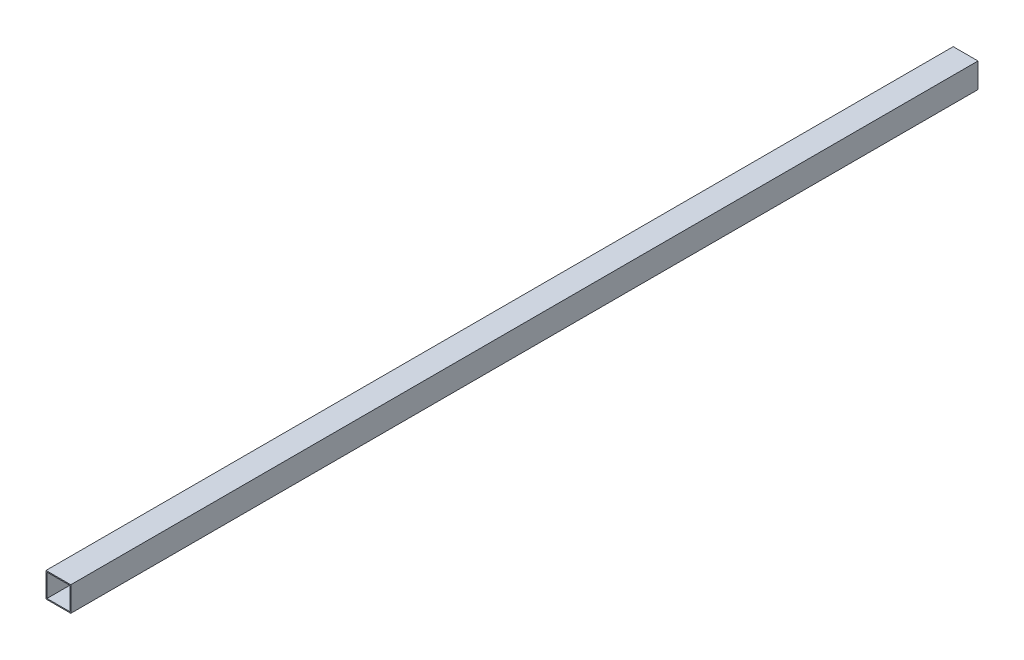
ISO-10303-21;
HEADER;
FILE_DESCRIPTION(('STEP AP214'),'2;1');
FILE_NAME('part.step','',(''),(''),'','','');
FILE_SCHEMA(('AUTOMOTIVE_DESIGN { 1 0 10303 214 1 1 1 1 }'));
ENDSEC;
DATA;
#1=APPLICATION_CONTEXT('core data for automotive mechanical design processes');
#2=APPLICATION_PROTOCOL_DEFINITION('international standard','automotive_design',2000,#1);
#3=PRODUCT_CONTEXT('',#1,'mechanical');
#4=PRODUCT('Part','Part','',(#3));
#5=PRODUCT_RELATED_PRODUCT_CATEGORY('part','',(#4));
#6=PRODUCT_DEFINITION_FORMATION('','',#4);
#7=PRODUCT_DEFINITION_CONTEXT('part definition',#1,'design');
#8=PRODUCT_DEFINITION('design','',#6,#7);
#9=PRODUCT_DEFINITION_SHAPE('','',#8);
#10=(LENGTH_UNIT() NAMED_UNIT(*) SI_UNIT(.MILLI.,.METRE.));
#11=(NAMED_UNIT(*) PLANE_ANGLE_UNIT() SI_UNIT($,.RADIAN.));
#12=(NAMED_UNIT(*) SI_UNIT($,.STERADIAN.) SOLID_ANGLE_UNIT());
#13=UNCERTAINTY_MEASURE_WITH_UNIT(LENGTH_MEASURE(1.E-05),#10,'distance_accuracy_value','');
#14=(GEOMETRIC_REPRESENTATION_CONTEXT(3) GLOBAL_UNCERTAINTY_ASSIGNED_CONTEXT((#13)) GLOBAL_UNIT_ASSIGNED_CONTEXT((#10,
#11,#12)) REPRESENTATION_CONTEXT('',''));
#15=CARTESIAN_POINT('',(0.,0.,0.));
#16=DIRECTION('',(0.,0.,1.));
#17=DIRECTION('',(1.,0.,0.));
#18=AXIS2_PLACEMENT_3D('',#15,#16,#17);
#19=CARTESIAN_POINT('',(0.,0.,5488.));
#20=DIRECTION('',(0.,0.,1.));
#21=DIRECTION('',(1.,0.,0.));
#22=AXIS2_PLACEMENT_3D('',#19,#20,#21);
#23=PLANE('',#22);
#24=DIRECTION('',(0.,-1.,0.));
#25=VECTOR('',#24,1.);
#26=CARTESIAN_POINT('',(-69.,69.,5488.));
#27=LINE('',#26,#25);
#28=CARTESIAN_POINT('',(-69.,69.,5488.));
#29=VERTEX_POINT('',#28);
#30=CARTESIAN_POINT('',(-69.,-69.,5488.));
#31=VERTEX_POINT('',#30);
#32=EDGE_CURVE('E26',#29,#31,#27,.T.);
#33=ORIENTED_EDGE('',*,*,#32,.F.);
#34=DIRECTION('',(-1.,0.,0.));
#35=VECTOR('',#34,1.);
#36=CARTESIAN_POINT('',(69.,69.,5488.));
#37=LINE('',#36,#35);
#38=CARTESIAN_POINT('',(69.,69.,5488.));
#39=VERTEX_POINT('',#38);
#40=EDGE_CURVE('E76',#39,#29,#37,.T.);
#41=ORIENTED_EDGE('',*,*,#40,.F.);
#42=DIRECTION('',(0.,1.,0.));
#43=VECTOR('',#42,1.);
#44=CARTESIAN_POINT('',(69.,-69.,5488.));
#45=LINE('',#44,#43);
#46=CARTESIAN_POINT('',(69.,-69.,5488.));
#47=VERTEX_POINT('',#46);
#48=EDGE_CURVE('E186',#47,#39,#45,.T.);
#49=ORIENTED_EDGE('',*,*,#48,.F.);
#50=DIRECTION('',(1.,0.,0.));
#51=VECTOR('',#50,1.);
#52=CARTESIAN_POINT('',(-69.,-69.,5488.));
#53=LINE('',#52,#51);
#54=EDGE_CURVE('E153',#31,#47,#53,.T.);
#55=ORIENTED_EDGE('',*,*,#54,.F.);
#56=EDGE_LOOP('',(#33,#41,#49,#55));
#57=FACE_BOUND('',#56,.T.);
#58=DIRECTION('',(1.,0.,0.));
#59=VECTOR('',#58,1.);
#60=CARTESIAN_POINT('',(-75.,-75.,5488.));
#61=LINE('',#60,#59);
#62=CARTESIAN_POINT('',(-75.,-75.,5488.));
#63=VERTEX_POINT('',#62);
#64=CARTESIAN_POINT('',(75.,-75.,5488.));
#65=VERTEX_POINT('',#64);
#66=EDGE_CURVE('E138',#63,#65,#61,.T.);
#67=ORIENTED_EDGE('',*,*,#66,.T.);
#68=DIRECTION('',(0.,1.,0.));
#69=VECTOR('',#68,1.);
#70=CARTESIAN_POINT('',(75.,-75.,5488.));
#71=LINE('',#70,#69);
#72=CARTESIAN_POINT('',(75.,75.,5488.));
#73=VERTEX_POINT('',#72);
#74=EDGE_CURVE('E104',#65,#73,#71,.T.);
#75=ORIENTED_EDGE('',*,*,#74,.T.);
#76=DIRECTION('',(-1.,0.,0.));
#77=VECTOR('',#76,1.);
#78=CARTESIAN_POINT('',(75.,75.,5488.));
#79=LINE('',#78,#77);
#80=CARTESIAN_POINT('',(-75.,75.,5488.));
#81=VERTEX_POINT('',#80);
#82=EDGE_CURVE('E131',#73,#81,#79,.T.);
#83=ORIENTED_EDGE('',*,*,#82,.T.);
#84=DIRECTION('',(0.,-1.,0.));
#85=VECTOR('',#84,1.);
#86=CARTESIAN_POINT('',(-75.,75.,5488.));
#87=LINE('',#86,#85);
#88=EDGE_CURVE('E130',#81,#63,#87,.T.);
#89=ORIENTED_EDGE('',*,*,#88,.T.);
#90=EDGE_LOOP('',(#67,#75,#83,#89));
#91=FACE_BOUND('',#90,.T.);
#92=ADVANCED_FACE('F16',(#57,#91),#23,.T.);
#93=CARTESIAN_POINT('',(0.,0.,0.));
#94=DIRECTION('',(0.,0.,1.));
#95=DIRECTION('',(1.,0.,0.));
#96=AXIS2_PLACEMENT_3D('',#93,#94,#95);
#97=PLANE('',#96);
#98=DIRECTION('',(1.,0.,0.));
#99=VECTOR('',#98,1.);
#100=CARTESIAN_POINT('',(-69.,-69.,0.));
#101=LINE('',#100,#99);
#102=CARTESIAN_POINT('',(-69.,-69.,0.));
#103=VERTEX_POINT('',#102);
#104=CARTESIAN_POINT('',(69.,-69.,0.));
#105=VERTEX_POINT('',#104);
#106=EDGE_CURVE('E152',#103,#105,#101,.T.);
#107=ORIENTED_EDGE('',*,*,#106,.T.);
#108=DIRECTION('',(0.,1.,0.));
#109=VECTOR('',#108,1.);
#110=CARTESIAN_POINT('',(69.,-69.,0.));
#111=LINE('',#110,#109);
#112=CARTESIAN_POINT('',(69.,69.,0.));
#113=VERTEX_POINT('',#112);
#114=EDGE_CURVE('E88',#105,#113,#111,.T.);
#115=ORIENTED_EDGE('',*,*,#114,.T.);
#116=DIRECTION('',(-1.,0.,0.));
#117=VECTOR('',#116,1.);
#118=CARTESIAN_POINT('',(69.,69.,0.));
#119=LINE('',#118,#117);
#120=CARTESIAN_POINT('',(-69.,69.,0.));
#121=VERTEX_POINT('',#120);
#122=EDGE_CURVE('E183',#113,#121,#119,.T.);
#123=ORIENTED_EDGE('',*,*,#122,.T.);
#124=DIRECTION('',(0.,-1.,0.));
#125=VECTOR('',#124,1.);
#126=CARTESIAN_POINT('',(-69.,69.,0.));
#127=LINE('',#126,#125);
#128=EDGE_CURVE('E10',#121,#103,#127,.T.);
#129=ORIENTED_EDGE('',*,*,#128,.T.);
#130=EDGE_LOOP('',(#107,#115,#123,#129));
#131=FACE_BOUND('',#130,.T.);
#132=DIRECTION('',(0.,-1.,0.));
#133=VECTOR('',#132,1.);
#134=CARTESIAN_POINT('',(-75.,75.,0.));
#135=LINE('',#134,#133);
#136=CARTESIAN_POINT('',(-75.,75.,0.));
#137=VERTEX_POINT('',#136);
#138=CARTESIAN_POINT('',(-75.,-75.,0.));
#139=VERTEX_POINT('',#138);
#140=EDGE_CURVE('E121',#137,#139,#135,.T.);
#141=ORIENTED_EDGE('',*,*,#140,.F.);
#142=DIRECTION('',(-1.,0.,0.));
#143=VECTOR('',#142,1.);
#144=CARTESIAN_POINT('',(75.,75.,0.));
#145=LINE('',#144,#143);
#146=CARTESIAN_POINT('',(75.,75.,0.));
#147=VERTEX_POINT('',#146);
#148=EDGE_CURVE('E163',#147,#137,#145,.T.);
#149=ORIENTED_EDGE('',*,*,#148,.F.);
#150=DIRECTION('',(0.,1.,0.));
#151=VECTOR('',#150,1.);
#152=CARTESIAN_POINT('',(75.,-75.,0.));
#153=LINE('',#152,#151);
#154=CARTESIAN_POINT('',(75.,-75.,0.));
#155=VERTEX_POINT('',#154);
#156=EDGE_CURVE('E114',#155,#147,#153,.T.);
#157=ORIENTED_EDGE('',*,*,#156,.F.);
#158=DIRECTION('',(1.,0.,0.));
#159=VECTOR('',#158,1.);
#160=CARTESIAN_POINT('',(-75.,-75.,0.));
#161=LINE('',#160,#159);
#162=EDGE_CURVE('E137',#139,#155,#161,.T.);
#163=ORIENTED_EDGE('',*,*,#162,.F.);
#164=EDGE_LOOP('',(#141,#149,#157,#163));
#165=FACE_BOUND('',#164,.T.);
#166=ADVANCED_FACE('F141',(#131,#165),#97,.F.);
#167=CARTESIAN_POINT('',(-69.,69.,0.));
#168=DIRECTION('',(1.,0.,0.));
#169=DIRECTION('',(0.,1.,0.));
#170=AXIS2_PLACEMENT_3D('',#167,#168,#169);
#171=PLANE('',#170);
#172=DIRECTION('',(0.,0.,1.));
#173=VECTOR('',#172,1.);
#174=CARTESIAN_POINT('',(-69.,69.,0.));
#175=LINE('',#174,#173);
#176=EDGE_CURVE('E180',#121,#29,#175,.T.);
#177=ORIENTED_EDGE('',*,*,#176,.T.);
#178=ORIENTED_EDGE('',*,*,#32,.T.);
#179=DIRECTION('',(0.,0.,1.));
#180=VECTOR('',#179,1.);
#181=CARTESIAN_POINT('',(-69.,-69.,0.));
#182=LINE('',#181,#180);
#183=EDGE_CURVE('E167',#103,#31,#182,.T.);
#184=ORIENTED_EDGE('',*,*,#183,.F.);
#185=ORIENTED_EDGE('',*,*,#128,.F.);
#186=EDGE_LOOP('',(#177,#178,#184,#185));
#187=FACE_BOUND('',#186,.T.);
#188=ADVANCED_FACE('F18',(#187),#171,.T.);
#189=CARTESIAN_POINT('',(69.,69.,0.));
#190=DIRECTION('',(0.,-1.,0.));
#191=DIRECTION('',(0.,0.,-1.));
#192=AXIS2_PLACEMENT_3D('',#189,#190,#191);
#193=PLANE('',#192);
#194=DIRECTION('',(0.,0.,1.));
#195=VECTOR('',#194,1.);
#196=CARTESIAN_POINT('',(69.,69.,0.));
#197=LINE('',#196,#195);
#198=EDGE_CURVE('E190',#113,#39,#197,.T.);
#199=ORIENTED_EDGE('',*,*,#198,.T.);
#200=ORIENTED_EDGE('',*,*,#40,.T.);
#201=ORIENTED_EDGE('',*,*,#176,.F.);
#202=ORIENTED_EDGE('',*,*,#122,.F.);
#203=EDGE_LOOP('',(#199,#200,#201,#202));
#204=FACE_BOUND('',#203,.T.);
#205=ADVANCED_FACE('F209',(#204),#193,.T.);
#206=CARTESIAN_POINT('',(69.,-69.,0.));
#207=DIRECTION('',(-1.,0.,0.));
#208=DIRECTION('',(0.,0.,1.));
#209=AXIS2_PLACEMENT_3D('',#206,#207,#208);
#210=PLANE('',#209);
#211=DIRECTION('',(0.,0.,1.));
#212=VECTOR('',#211,1.);
#213=CARTESIAN_POINT('',(69.,-69.,0.));
#214=LINE('',#213,#212);
#215=EDGE_CURVE('E149',#105,#47,#214,.T.);
#216=ORIENTED_EDGE('',*,*,#215,.T.);
#217=ORIENTED_EDGE('',*,*,#48,.T.);
#218=ORIENTED_EDGE('',*,*,#198,.F.);
#219=ORIENTED_EDGE('',*,*,#114,.F.);
#220=EDGE_LOOP('',(#216,#217,#218,#219));
#221=FACE_BOUND('',#220,.T.);
#222=ADVANCED_FACE('F210',(#221),#210,.T.);
#223=CARTESIAN_POINT('',(-69.,-69.,0.));
#224=DIRECTION('',(0.,1.,0.));
#225=DIRECTION('',(1.,0.,0.));
#226=AXIS2_PLACEMENT_3D('',#223,#224,#225);
#227=PLANE('',#226);
#228=ORIENTED_EDGE('',*,*,#183,.T.);
#229=ORIENTED_EDGE('',*,*,#54,.T.);
#230=ORIENTED_EDGE('',*,*,#215,.F.);
#231=ORIENTED_EDGE('',*,*,#106,.F.);
#232=EDGE_LOOP('',(#228,#229,#230,#231));
#233=FACE_BOUND('',#232,.T.);
#234=ADVANCED_FACE('F206',(#233),#227,.T.);
#235=CARTESIAN_POINT('',(-75.,75.,0.));
#236=DIRECTION('',(1.,0.,0.));
#237=DIRECTION('',(0.,1.,0.));
#238=AXIS2_PLACEMENT_3D('',#235,#236,#237);
#239=PLANE('',#238);
#240=ORIENTED_EDGE('',*,*,#140,.T.);
#241=DIRECTION('',(0.,0.,1.));
#242=VECTOR('',#241,1.);
#243=CARTESIAN_POINT('',(-75.,-75.,0.));
#244=LINE('',#243,#242);
#245=EDGE_CURVE('E124',#139,#63,#244,.T.);
#246=ORIENTED_EDGE('',*,*,#245,.T.);
#247=ORIENTED_EDGE('',*,*,#88,.F.);
#248=DIRECTION('',(0.,0.,1.));
#249=VECTOR('',#248,1.);
#250=CARTESIAN_POINT('',(-75.,75.,0.));
#251=LINE('',#250,#249);
#252=EDGE_CURVE('E127',#137,#81,#251,.T.);
#253=ORIENTED_EDGE('',*,*,#252,.F.);
#254=EDGE_LOOP('',(#240,#246,#247,#253));
#255=FACE_BOUND('',#254,.T.);
#256=ADVANCED_FACE('F123',(#255),#239,.F.);
#257=CARTESIAN_POINT('',(75.,75.,0.));
#258=DIRECTION('',(0.,-1.,0.));
#259=DIRECTION('',(0.,0.,-1.));
#260=AXIS2_PLACEMENT_3D('',#257,#258,#259);
#261=PLANE('',#260);
#262=ORIENTED_EDGE('',*,*,#148,.T.);
#263=ORIENTED_EDGE('',*,*,#252,.T.);
#264=ORIENTED_EDGE('',*,*,#82,.F.);
#265=DIRECTION('',(0.,0.,1.));
#266=VECTOR('',#265,1.);
#267=CARTESIAN_POINT('',(75.,75.,0.));
#268=LINE('',#267,#266);
#269=EDGE_CURVE('E158',#147,#73,#268,.T.);
#270=ORIENTED_EDGE('',*,*,#269,.F.);
#271=EDGE_LOOP('',(#262,#263,#264,#270));
#272=FACE_BOUND('',#271,.T.);
#273=ADVANCED_FACE('F228',(#272),#261,.F.);
#274=CARTESIAN_POINT('',(75.,-75.,0.));
#275=DIRECTION('',(-1.,0.,0.));
#276=DIRECTION('',(0.,0.,1.));
#277=AXIS2_PLACEMENT_3D('',#274,#275,#276);
#278=PLANE('',#277);
#279=ORIENTED_EDGE('',*,*,#156,.T.);
#280=ORIENTED_EDGE('',*,*,#269,.T.);
#281=ORIENTED_EDGE('',*,*,#74,.F.);
#282=DIRECTION('',(0.,0.,1.));
#283=VECTOR('',#282,1.);
#284=CARTESIAN_POINT('',(75.,-75.,0.));
#285=LINE('',#284,#283);
#286=EDGE_CURVE('E143',#155,#65,#285,.T.);
#287=ORIENTED_EDGE('',*,*,#286,.F.);
#288=EDGE_LOOP('',(#279,#280,#281,#287));
#289=FACE_BOUND('',#288,.T.);
#290=ADVANCED_FACE('F231',(#289),#278,.F.);
#291=CARTESIAN_POINT('',(-75.,-75.,0.));
#292=DIRECTION('',(0.,1.,0.));
#293=DIRECTION('',(1.,0.,0.));
#294=AXIS2_PLACEMENT_3D('',#291,#292,#293);
#295=PLANE('',#294);
#296=ORIENTED_EDGE('',*,*,#162,.T.);
#297=ORIENTED_EDGE('',*,*,#286,.T.);
#298=ORIENTED_EDGE('',*,*,#66,.F.);
#299=ORIENTED_EDGE('',*,*,#245,.F.);
#300=EDGE_LOOP('',(#296,#297,#298,#299));
#301=FACE_BOUND('',#300,.T.);
#302=ADVANCED_FACE('F135',(#301),#295,.F.);
#303=CLOSED_SHELL('',(#92,#166,#188,#205,#222,#234,#256,#273,#290,#302));
#304=MANIFOLD_SOLID_BREP('B1',#303);
#305=ADVANCED_BREP_SHAPE_REPRESENTATION('',(#18,#304),#14);
#306=SHAPE_DEFINITION_REPRESENTATION(#9,#305);
ENDSEC;
END-ISO-10303-21;
